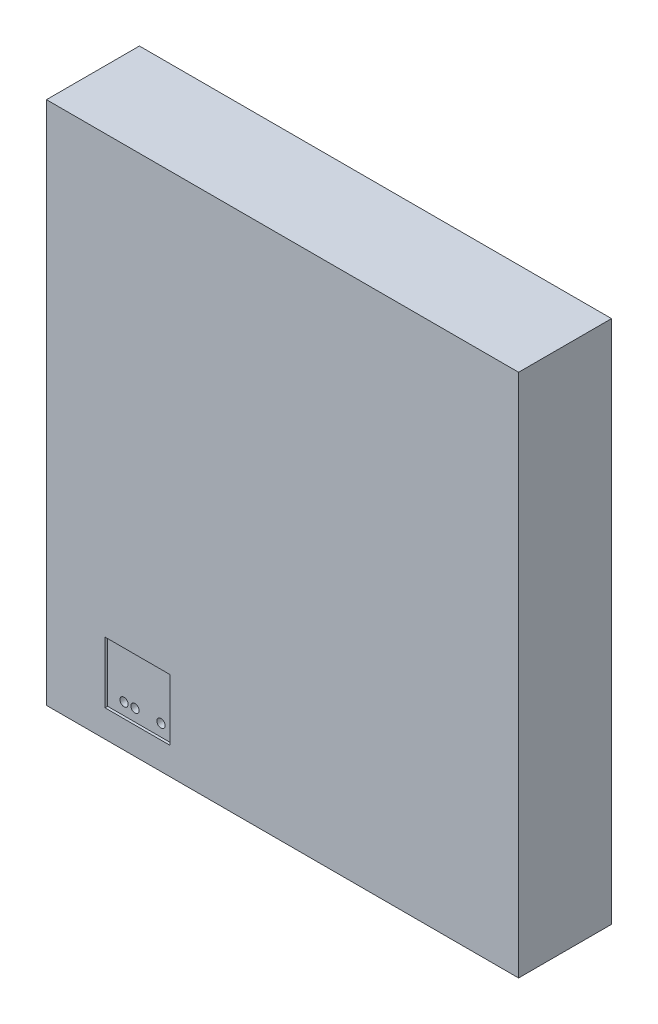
ISO-10303-21;
HEADER;
FILE_DESCRIPTION(('STEP AP214'),'2;1');
FILE_NAME('part.step','',(''),(''),'','','');
FILE_SCHEMA(('AUTOMOTIVE_DESIGN { 1 0 10303 214 1 1 1 1 }'));
ENDSEC;
DATA;
#1=APPLICATION_CONTEXT('core data for automotive mechanical design processes');
#2=APPLICATION_PROTOCOL_DEFINITION('international standard','automotive_design',2000,#1);
#3=PRODUCT_CONTEXT('',#1,'mechanical');
#4=PRODUCT('Part','Part','',(#3));
#5=PRODUCT_RELATED_PRODUCT_CATEGORY('part','',(#4));
#6=PRODUCT_DEFINITION_FORMATION('','',#4);
#7=PRODUCT_DEFINITION_CONTEXT('part definition',#1,'design');
#8=PRODUCT_DEFINITION('design','',#6,#7);
#9=PRODUCT_DEFINITION_SHAPE('','',#8);
#10=(LENGTH_UNIT() NAMED_UNIT(*) SI_UNIT(.MILLI.,.METRE.));
#11=(NAMED_UNIT(*) PLANE_ANGLE_UNIT() SI_UNIT($,.RADIAN.));
#12=(NAMED_UNIT(*) SI_UNIT($,.STERADIAN.) SOLID_ANGLE_UNIT());
#13=UNCERTAINTY_MEASURE_WITH_UNIT(LENGTH_MEASURE(1.E-05),#10,'distance_accuracy_value','');
#14=(GEOMETRIC_REPRESENTATION_CONTEXT(3) GLOBAL_UNCERTAINTY_ASSIGNED_CONTEXT((#13)) GLOBAL_UNIT_ASSIGNED_CONTEXT((#10,
#11,#12)) REPRESENTATION_CONTEXT('',''));
#15=CARTESIAN_POINT('',(0.,0.,0.));
#16=DIRECTION('',(0.,0.,1.));
#17=DIRECTION('',(1.,0.,0.));
#18=AXIS2_PLACEMENT_3D('',#15,#16,#17);
#19=CARTESIAN_POINT('',(0.,508.,0.));
#20=DIRECTION('',(0.,0.,-1.));
#21=DIRECTION('',(-1.,0.,0.));
#22=AXIS2_PLACEMENT_3D('',#19,#20,#21);
#23=PLANE('',#22);
#24=DIRECTION('',(0.,-1.,0.));
#25=VECTOR('',#24,1.);
#26=CARTESIAN_POINT('',(0.,0.,0.));
#27=LINE('',#26,#25);
#28=CARTESIAN_POINT('',(0.,508.,0.));
#29=VERTEX_POINT('',#28);
#30=CARTESIAN_POINT('',(0.,0.,0.));
#31=VERTEX_POINT('',#30);
#32=EDGE_CURVE('E131',#29,#31,#27,.T.);
#33=ORIENTED_EDGE('',*,*,#32,.T.);
#34=DIRECTION('',(1.,0.,0.));
#35=VECTOR('',#34,1.);
#36=CARTESIAN_POINT('',(0.,0.,0.));
#37=LINE('',#36,#35);
#38=CARTESIAN_POINT('',(457.2,0.,0.));
#39=VERTEX_POINT('',#38);
#40=EDGE_CURVE('E135',#31,#39,#37,.T.);
#41=ORIENTED_EDGE('',*,*,#40,.T.);
#42=DIRECTION('',(0.,1.,0.));
#43=VECTOR('',#42,1.);
#44=CARTESIAN_POINT('',(457.2,0.,0.));
#45=LINE('',#44,#43);
#46=CARTESIAN_POINT('',(457.2,508.,0.));
#47=VERTEX_POINT('',#46);
#48=EDGE_CURVE('E153',#39,#47,#45,.T.);
#49=ORIENTED_EDGE('',*,*,#48,.T.);
#50=DIRECTION('',(-1.,0.,0.));
#51=VECTOR('',#50,1.);
#52=CARTESIAN_POINT('',(0.,508.,0.));
#53=LINE('',#52,#51);
#54=EDGE_CURVE('E144',#47,#29,#53,.T.);
#55=ORIENTED_EDGE('',*,*,#54,.T.);
#56=EDGE_LOOP('',(#33,#41,#49,#55));
#57=FACE_BOUND('',#56,.T.);
#58=DIRECTION('',(0.,1.,0.));
#59=VECTOR('',#58,1.);
#60=CARTESIAN_POINT('',(56.7409467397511,26.3332587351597,0.));
#61=LINE('',#60,#59);
#62=CARTESIAN_POINT('',(56.7409467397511,26.3332587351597,0.));
#63=VERTEX_POINT('',#62);
#64=CARTESIAN_POINT('',(56.7409467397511,85.6850056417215,0.));
#65=VERTEX_POINT('',#64);
#66=EDGE_CURVE('E53',#63,#65,#61,.T.);
#67=ORIENTED_EDGE('',*,*,#66,.T.);
#68=DIRECTION('',(1.,0.,0.));
#69=VECTOR('',#68,1.);
#70=CARTESIAN_POINT('',(56.7409467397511,85.6850056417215,0.));
#71=LINE('',#70,#69);
#72=CARTESIAN_POINT('',(119.634718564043,85.6850056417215,0.));
#73=VERTEX_POINT('',#72);
#74=EDGE_CURVE('E130',#65,#73,#71,.T.);
#75=ORIENTED_EDGE('',*,*,#74,.T.);
#76=DIRECTION('',(0.,1.,0.));
#77=VECTOR('',#76,1.);
#78=CARTESIAN_POINT('',(119.634718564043,26.3332587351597,0.));
#79=LINE('',#78,#77);
#80=CARTESIAN_POINT('',(119.634718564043,26.3332587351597,0.));
#81=VERTEX_POINT('',#80);
#82=EDGE_CURVE('E185',#81,#73,#79,.T.);
#83=ORIENTED_EDGE('',*,*,#82,.F.);
#84=DIRECTION('',(1.,0.,0.));
#85=VECTOR('',#84,1.);
#86=CARTESIAN_POINT('',(56.7409467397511,26.3332587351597,0.));
#87=LINE('',#86,#85);
#88=EDGE_CURVE('E126',#63,#81,#87,.T.);
#89=ORIENTED_EDGE('',*,*,#88,.F.);
#90=EDGE_LOOP('',(#67,#75,#83,#89));
#91=FACE_BOUND('',#90,.T.);
#92=ADVANCED_FACE('F36',(#57,#91),#23,.F.);
#93=CARTESIAN_POINT('',(0.,0.,-90.));
#94=DIRECTION('',(-1.,0.,0.));
#95=DIRECTION('',(0.,0.,1.));
#96=AXIS2_PLACEMENT_3D('',#93,#94,#95);
#97=PLANE('',#96);
#98=ORIENTED_EDGE('',*,*,#32,.F.);
#99=DIRECTION('',(0.,0.,1.));
#100=VECTOR('',#99,1.);
#101=CARTESIAN_POINT('',(0.,508.,-90.));
#102=LINE('',#101,#100);
#103=CARTESIAN_POINT('',(0.,508.,-90.));
#104=VERTEX_POINT('',#103);
#105=EDGE_CURVE('E11',#104,#29,#102,.T.);
#106=ORIENTED_EDGE('',*,*,#105,.F.);
#107=DIRECTION('',(0.,-1.,0.));
#108=VECTOR('',#107,1.);
#109=CARTESIAN_POINT('',(0.,0.,-90.));
#110=LINE('',#109,#108);
#111=CARTESIAN_POINT('',(0.,0.,-90.));
#112=VERTEX_POINT('',#111);
#113=EDGE_CURVE('E141',#104,#112,#110,.T.);
#114=ORIENTED_EDGE('',*,*,#113,.T.);
#115=DIRECTION('',(0.,0.,1.));
#116=VECTOR('',#115,1.);
#117=CARTESIAN_POINT('',(0.,0.,-90.));
#118=LINE('',#117,#116);
#119=EDGE_CURVE('E86',#112,#31,#118,.T.);
#120=ORIENTED_EDGE('',*,*,#119,.T.);
#121=EDGE_LOOP('',(#98,#106,#114,#120));
#122=FACE_BOUND('',#121,.T.);
#123=ADVANCED_FACE('F38',(#122),#97,.T.);
#124=CARTESIAN_POINT('',(0.,508.,-90.));
#125=DIRECTION('',(0.,1.,0.));
#126=DIRECTION('',(0.,0.,1.));
#127=AXIS2_PLACEMENT_3D('',#124,#125,#126);
#128=PLANE('',#127);
#129=ORIENTED_EDGE('',*,*,#54,.F.);
#130=DIRECTION('',(0.,0.,1.));
#131=VECTOR('',#130,1.);
#132=CARTESIAN_POINT('',(457.2,508.,-90.));
#133=LINE('',#132,#131);
#134=CARTESIAN_POINT('',(457.2,508.,-90.));
#135=VERTEX_POINT('',#134);
#136=EDGE_CURVE('E45',#135,#47,#133,.T.);
#137=ORIENTED_EDGE('',*,*,#136,.F.);
#138=DIRECTION('',(-1.,0.,0.));
#139=VECTOR('',#138,1.);
#140=CARTESIAN_POINT('',(0.,508.,-90.));
#141=LINE('',#140,#139);
#142=EDGE_CURVE('E149',#135,#104,#141,.T.);
#143=ORIENTED_EDGE('',*,*,#142,.T.);
#144=ORIENTED_EDGE('',*,*,#105,.T.);
#145=EDGE_LOOP('',(#129,#137,#143,#144));
#146=FACE_BOUND('',#145,.T.);
#147=ADVANCED_FACE('F203',(#146),#128,.T.);
#148=CARTESIAN_POINT('',(457.2,0.,-90.));
#149=DIRECTION('',(1.,0.,0.));
#150=DIRECTION('',(0.,0.,-1.));
#151=AXIS2_PLACEMENT_3D('',#148,#149,#150);
#152=PLANE('',#151);
#153=ORIENTED_EDGE('',*,*,#48,.F.);
#154=DIRECTION('',(0.,0.,1.));
#155=VECTOR('',#154,1.);
#156=CARTESIAN_POINT('',(457.2,0.,-90.));
#157=LINE('',#156,#155);
#158=CARTESIAN_POINT('',(457.2,0.,-90.));
#159=VERTEX_POINT('',#158);
#160=EDGE_CURVE('E159',#159,#39,#157,.T.);
#161=ORIENTED_EDGE('',*,*,#160,.F.);
#162=DIRECTION('',(0.,1.,0.));
#163=VECTOR('',#162,1.);
#164=CARTESIAN_POINT('',(457.2,0.,-90.));
#165=LINE('',#164,#163);
#166=EDGE_CURVE('E146',#159,#135,#165,.T.);
#167=ORIENTED_EDGE('',*,*,#166,.T.);
#168=ORIENTED_EDGE('',*,*,#136,.T.);
#169=EDGE_LOOP('',(#153,#161,#167,#168));
#170=FACE_BOUND('',#169,.T.);
#171=ADVANCED_FACE('F210',(#170),#152,.T.);
#172=CARTESIAN_POINT('',(0.,0.,-90.));
#173=DIRECTION('',(0.,-1.,0.));
#174=DIRECTION('',(0.,0.,-1.));
#175=AXIS2_PLACEMENT_3D('',#172,#173,#174);
#176=PLANE('',#175);
#177=ORIENTED_EDGE('',*,*,#40,.F.);
#178=ORIENTED_EDGE('',*,*,#119,.F.);
#179=DIRECTION('',(1.,0.,0.));
#180=VECTOR('',#179,1.);
#181=CARTESIAN_POINT('',(0.,0.,-90.));
#182=LINE('',#181,#180);
#183=EDGE_CURVE('E143',#112,#159,#182,.T.);
#184=ORIENTED_EDGE('',*,*,#183,.T.);
#185=ORIENTED_EDGE('',*,*,#160,.T.);
#186=EDGE_LOOP('',(#177,#178,#184,#185));
#187=FACE_BOUND('',#186,.T.);
#188=ADVANCED_FACE('F212',(#187),#176,.T.);
#189=CARTESIAN_POINT('',(0.,508.,-90.));
#190=DIRECTION('',(0.,0.,-1.));
#191=DIRECTION('',(-1.,0.,0.));
#192=AXIS2_PLACEMENT_3D('',#189,#190,#191);
#193=PLANE('',#192);
#194=ORIENTED_EDGE('',*,*,#113,.F.);
#195=ORIENTED_EDGE('',*,*,#142,.F.);
#196=ORIENTED_EDGE('',*,*,#166,.F.);
#197=ORIENTED_EDGE('',*,*,#183,.F.);
#198=EDGE_LOOP('',(#194,#195,#196,#197));
#199=FACE_BOUND('',#198,.T.);
#200=ADVANCED_FACE('F206',(#199),#193,.T.);
#201=CARTESIAN_POINT('',(56.7409467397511,26.3332587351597,-2.54));
#202=DIRECTION('',(1.,0.,0.));
#203=DIRECTION('',(0.,0.,-1.));
#204=AXIS2_PLACEMENT_3D('',#201,#202,#203);
#205=PLANE('',#204);
#206=ORIENTED_EDGE('',*,*,#66,.F.);
#207=DIRECTION('',(0.,0.,1.));
#208=VECTOR('',#207,1.);
#209=CARTESIAN_POINT('',(56.7409467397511,26.3332587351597,-2.54));
#210=LINE('',#209,#208);
#211=CARTESIAN_POINT('',(56.7409467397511,26.3332587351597,-2.54));
#212=VERTEX_POINT('',#211);
#213=EDGE_CURVE('E125',#212,#63,#210,.T.);
#214=ORIENTED_EDGE('',*,*,#213,.F.);
#215=DIRECTION('',(0.,1.,0.));
#216=VECTOR('',#215,1.);
#217=CARTESIAN_POINT('',(56.7409467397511,26.3332587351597,-2.54));
#218=LINE('',#217,#216);
#219=CARTESIAN_POINT('',(56.7409467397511,85.6850056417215,-2.54));
#220=VERTEX_POINT('',#219);
#221=EDGE_CURVE('E115',#212,#220,#218,.T.);
#222=ORIENTED_EDGE('',*,*,#221,.T.);
#223=DIRECTION('',(0.,0.,1.));
#224=VECTOR('',#223,1.);
#225=CARTESIAN_POINT('',(56.7409467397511,85.6850056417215,-2.54));
#226=LINE('',#225,#224);
#227=EDGE_CURVE('E124',#220,#65,#226,.T.);
#228=ORIENTED_EDGE('',*,*,#227,.T.);
#229=EDGE_LOOP('',(#206,#214,#222,#228));
#230=FACE_BOUND('',#229,.T.);
#231=ADVANCED_FACE('F123',(#230),#205,.T.);
#232=CARTESIAN_POINT('',(56.7409467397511,85.6850056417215,-2.54));
#233=DIRECTION('',(0.,-1.,0.));
#234=DIRECTION('',(0.,0.,-1.));
#235=AXIS2_PLACEMENT_3D('',#232,#233,#234);
#236=PLANE('',#235);
#237=ORIENTED_EDGE('',*,*,#74,.F.);
#238=ORIENTED_EDGE('',*,*,#227,.F.);
#239=DIRECTION('',(1.,0.,0.));
#240=VECTOR('',#239,1.);
#241=CARTESIAN_POINT('',(56.7409467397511,85.6850056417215,-2.54));
#242=LINE('',#241,#240);
#243=CARTESIAN_POINT('',(119.634718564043,85.6850056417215,-2.54));
#244=VERTEX_POINT('',#243);
#245=EDGE_CURVE('E111',#220,#244,#242,.T.);
#246=ORIENTED_EDGE('',*,*,#245,.T.);
#247=DIRECTION('',(0.,0.,1.));
#248=VECTOR('',#247,1.);
#249=CARTESIAN_POINT('',(119.634718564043,85.6850056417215,-2.54));
#250=LINE('',#249,#248);
#251=EDGE_CURVE('E132',#244,#73,#250,.T.);
#252=ORIENTED_EDGE('',*,*,#251,.T.);
#253=EDGE_LOOP('',(#237,#238,#246,#252));
#254=FACE_BOUND('',#253,.T.);
#255=ADVANCED_FACE('F128',(#254),#236,.T.);
#256=CARTESIAN_POINT('',(119.634718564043,26.3332587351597,-2.54));
#257=DIRECTION('',(1.,0.,0.));
#258=DIRECTION('',(0.,0.,-1.));
#259=AXIS2_PLACEMENT_3D('',#256,#257,#258);
#260=PLANE('',#259);
#261=ORIENTED_EDGE('',*,*,#82,.T.);
#262=ORIENTED_EDGE('',*,*,#251,.F.);
#263=DIRECTION('',(0.,1.,0.));
#264=VECTOR('',#263,1.);
#265=CARTESIAN_POINT('',(119.634718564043,26.3332587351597,-2.54));
#266=LINE('',#265,#264);
#267=CARTESIAN_POINT('',(119.634718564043,26.3332587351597,-2.54));
#268=VERTEX_POINT('',#267);
#269=EDGE_CURVE('E118',#268,#244,#266,.T.);
#270=ORIENTED_EDGE('',*,*,#269,.F.);
#271=DIRECTION('',(0.,0.,1.));
#272=VECTOR('',#271,1.);
#273=CARTESIAN_POINT('',(119.634718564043,26.3332587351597,-2.54));
#274=LINE('',#273,#272);
#275=EDGE_CURVE('E137',#268,#81,#274,.T.);
#276=ORIENTED_EDGE('',*,*,#275,.T.);
#277=EDGE_LOOP('',(#261,#262,#270,#276));
#278=FACE_BOUND('',#277,.T.);
#279=ADVANCED_FACE('F191',(#278),#260,.F.);
#280=CARTESIAN_POINT('',(56.7409467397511,26.3332587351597,-2.54));
#281=DIRECTION('',(0.,-1.,0.));
#282=DIRECTION('',(0.,0.,-1.));
#283=AXIS2_PLACEMENT_3D('',#280,#281,#282);
#284=PLANE('',#283);
#285=ORIENTED_EDGE('',*,*,#88,.T.);
#286=ORIENTED_EDGE('',*,*,#275,.F.);
#287=DIRECTION('',(1.,0.,0.));
#288=VECTOR('',#287,1.);
#289=CARTESIAN_POINT('',(56.7409467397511,26.3332587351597,-2.54));
#290=LINE('',#289,#288);
#291=EDGE_CURVE('E181',#212,#268,#290,.T.);
#292=ORIENTED_EDGE('',*,*,#291,.F.);
#293=ORIENTED_EDGE('',*,*,#213,.T.);
#294=EDGE_LOOP('',(#285,#286,#292,#293));
#295=FACE_BOUND('',#294,.T.);
#296=ADVANCED_FACE('F195',(#295),#284,.F.);
#297=CARTESIAN_POINT('',(56.7409467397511,85.6850056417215,-2.54));
#298=DIRECTION('',(0.,0.,-1.));
#299=DIRECTION('',(-1.,0.,0.));
#300=AXIS2_PLACEMENT_3D('',#297,#298,#299);
#301=PLANE('',#300);
#302=CARTESIAN_POINT('',(108.390354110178,37.9020703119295,-2.54));
#303=DIRECTION('',(0.,0.,-1.));
#304=DIRECTION('',(-1.,0.,0.));
#305=AXIS2_PLACEMENT_3D('',#302,#303,#304);
#306=CIRCLE('',#305,4.00000000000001);
#307=CARTESIAN_POINT('',(104.390354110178,37.9020703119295,-2.54));
#308=VERTEX_POINT('',#307);
#309=EDGE_CURVE('E40',#308,#308,#306,.T.);
#310=ORIENTED_EDGE('',*,*,#309,.T.);
#311=EDGE_LOOP('',(#310));
#312=FACE_BOUND('',#311,.T.);
#313=CARTESIAN_POINT('',(83.2082590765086,37.9020703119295,-2.54));
#314=DIRECTION('',(0.,0.,-1.));
#315=DIRECTION('',(-1.,0.,0.));
#316=AXIS2_PLACEMENT_3D('',#313,#314,#315);
#317=CIRCLE('',#316,4.00000000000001);
#318=CARTESIAN_POINT('',(79.2082590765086,37.9020703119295,-2.54));
#319=VERTEX_POINT('',#318);
#320=EDGE_CURVE('E165',#319,#319,#317,.T.);
#321=ORIENTED_EDGE('',*,*,#320,.T.);
#322=EDGE_LOOP('',(#321));
#323=FACE_BOUND('',#322,.T.);
#324=CARTESIAN_POINT('',(72.5708490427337,37.9020703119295,-2.54));
#325=DIRECTION('',(0.,0.,-1.));
#326=DIRECTION('',(-1.,0.,0.));
#327=AXIS2_PLACEMENT_3D('',#324,#325,#326);
#328=CIRCLE('',#327,3.99999999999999);
#329=CARTESIAN_POINT('',(68.5708490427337,37.9020703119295,-2.54));
#330=VERTEX_POINT('',#329);
#331=EDGE_CURVE('E162',#330,#330,#328,.T.);
#332=ORIENTED_EDGE('',*,*,#331,.T.);
#333=EDGE_LOOP('',(#332));
#334=FACE_BOUND('',#333,.T.);
#335=ORIENTED_EDGE('',*,*,#221,.F.);
#336=ORIENTED_EDGE('',*,*,#291,.T.);
#337=ORIENTED_EDGE('',*,*,#269,.T.);
#338=ORIENTED_EDGE('',*,*,#245,.F.);
#339=EDGE_LOOP('',(#335,#336,#337,#338));
#340=FACE_BOUND('',#339,.T.);
#341=ADVANCED_FACE('F113',(#312,#323,#334,#340),#301,.F.);
#342=CARTESIAN_POINT('',(72.5708490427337,37.9020703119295,-20.));
#343=DIRECTION('',(0.,0.,1.));
#344=DIRECTION('',(1.,0.,0.));
#345=AXIS2_PLACEMENT_3D('',#342,#343,#344);
#346=CYLINDRICAL_SURFACE('',#345,3.99999999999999);
#347=CARTESIAN_POINT('',(72.5708490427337,37.9020703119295,-20.));
#348=DIRECTION('',(0.,0.,1.));
#349=DIRECTION('',(1.,0.,0.));
#350=AXIS2_PLACEMENT_3D('',#347,#348,#349);
#351=CIRCLE('',#350,3.99999999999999);
#352=CARTESIAN_POINT('',(76.5708490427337,37.9020703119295,-20.));
#353=VERTEX_POINT('',#352);
#354=EDGE_CURVE('E164',#353,#353,#351,.T.);
#355=ORIENTED_EDGE('',*,*,#354,.F.);
#356=EDGE_LOOP('',(#355));
#357=FACE_BOUND('',#356,.T.);
#358=ORIENTED_EDGE('',*,*,#331,.F.);
#359=EDGE_LOOP('',(#358));
#360=FACE_BOUND('',#359,.T.);
#361=ADVANCED_FACE('F236',(#357,#360),#346,.F.);
#362=CARTESIAN_POINT('',(72.5708490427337,37.9020703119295,-20.));
#363=DIRECTION('',(0.,0.,1.));
#364=DIRECTION('',(1.,0.,0.));
#365=AXIS2_PLACEMENT_3D('',#362,#363,#364);
#366=PLANE('',#365);
#367=ORIENTED_EDGE('',*,*,#354,.T.);
#368=EDGE_LOOP('',(#367));
#369=FACE_BOUND('',#368,.T.);
#370=ADVANCED_FACE('F240',(#369),#366,.T.);
#371=CARTESIAN_POINT('',(83.2082590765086,37.9020703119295,-20.));
#372=DIRECTION('',(0.,0.,1.));
#373=DIRECTION('',(1.,0.,0.));
#374=AXIS2_PLACEMENT_3D('',#371,#372,#373);
#375=CYLINDRICAL_SURFACE('',#374,4.00000000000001);
#376=CARTESIAN_POINT('',(83.2082590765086,37.9020703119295,-20.));
#377=DIRECTION('',(0.,0.,1.));
#378=DIRECTION('',(1.,0.,0.));
#379=AXIS2_PLACEMENT_3D('',#376,#377,#378);
#380=CIRCLE('',#379,4.00000000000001);
#381=CARTESIAN_POINT('',(87.2082590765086,37.9020703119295,-20.));
#382=VERTEX_POINT('',#381);
#383=EDGE_CURVE('E167',#382,#382,#380,.T.);
#384=ORIENTED_EDGE('',*,*,#383,.F.);
#385=EDGE_LOOP('',(#384));
#386=FACE_BOUND('',#385,.T.);
#387=ORIENTED_EDGE('',*,*,#320,.F.);
#388=EDGE_LOOP('',(#387));
#389=FACE_BOUND('',#388,.T.);
#390=ADVANCED_FACE('F244',(#386,#389),#375,.F.);
#391=CARTESIAN_POINT('',(83.2082590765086,37.9020703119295,-20.));
#392=DIRECTION('',(0.,0.,1.));
#393=DIRECTION('',(1.,0.,0.));
#394=AXIS2_PLACEMENT_3D('',#391,#392,#393);
#395=PLANE('',#394);
#396=ORIENTED_EDGE('',*,*,#383,.T.);
#397=EDGE_LOOP('',(#396));
#398=FACE_BOUND('',#397,.T.);
#399=ADVANCED_FACE('F246',(#398),#395,.T.);
#400=CARTESIAN_POINT('',(108.390354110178,37.9020703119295,-20.));
#401=DIRECTION('',(0.,0.,1.));
#402=DIRECTION('',(1.,0.,0.));
#403=AXIS2_PLACEMENT_3D('',#400,#401,#402);
#404=CYLINDRICAL_SURFACE('',#403,4.00000000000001);
#405=CARTESIAN_POINT('',(108.390354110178,37.9020703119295,-20.));
#406=DIRECTION('',(0.,0.,1.));
#407=DIRECTION('',(1.,0.,0.));
#408=AXIS2_PLACEMENT_3D('',#405,#406,#407);
#409=CIRCLE('',#408,4.00000000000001);
#410=CARTESIAN_POINT('',(112.390354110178,37.9020703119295,-20.));
#411=VERTEX_POINT('',#410);
#412=EDGE_CURVE('E177',#411,#411,#409,.T.);
#413=ORIENTED_EDGE('',*,*,#412,.F.);
#414=EDGE_LOOP('',(#413));
#415=FACE_BOUND('',#414,.T.);
#416=ORIENTED_EDGE('',*,*,#309,.F.);
#417=EDGE_LOOP('',(#416));
#418=FACE_BOUND('',#417,.T.);
#419=ADVANCED_FACE('F249',(#415,#418),#404,.F.);
#420=CARTESIAN_POINT('',(108.390354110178,37.9020703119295,-20.));
#421=DIRECTION('',(0.,0.,1.));
#422=DIRECTION('',(1.,0.,0.));
#423=AXIS2_PLACEMENT_3D('',#420,#421,#422);
#424=PLANE('',#423);
#425=ORIENTED_EDGE('',*,*,#412,.T.);
#426=EDGE_LOOP('',(#425));
#427=FACE_BOUND('',#426,.T.);
#428=ADVANCED_FACE('F253',(#427),#424,.T.);
#429=CLOSED_SHELL('',(#92,#123,#147,#171,#188,#200,#231,#255,#279,#296,#341,#361,#370,#390,#399,
#419,#428));
#430=MANIFOLD_SOLID_BREP('B2',#429);
#431=ADVANCED_BREP_SHAPE_REPRESENTATION('',(#18,#430),#14);
#432=SHAPE_DEFINITION_REPRESENTATION(#9,#431);
ENDSEC;
END-ISO-10303-21;
